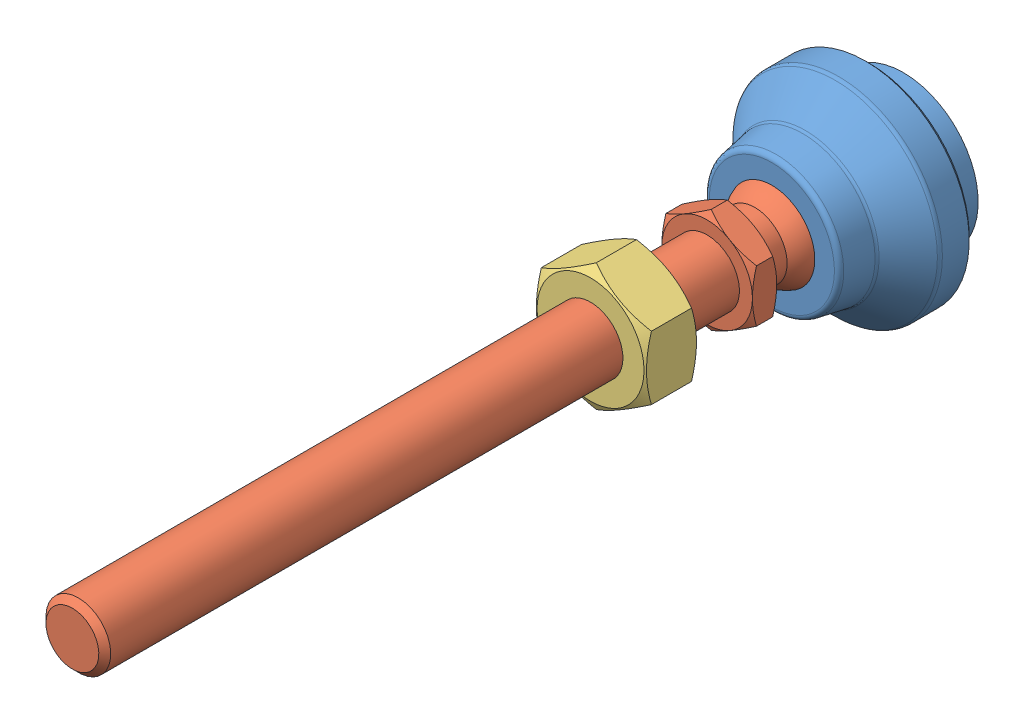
SolidWorks assembly LSVA32-M10X98.sldasm, configuration Default (file format 15000). Lengths in mm.
Overall size (32 32 128.3).
3 component instances, 3 part files, 0 mates.
Components (placement in the parent):
- LSVA32-M10X98_01-1: LSVA32-M10X98_01.SLDPRT [Default] at (0 0 5.3) x (1 0 0) z (0 -1 0) size (32 20.3 32)
- LSVA32-M10X98_02-1: LSVA32-M10X98_02.sldprt [Default] at (0 0 18.05) x (1 0 0) z (0 -1 0) size (14 117.25 16.17)
- LSVA32-M10X98_03-1: LSVA32-M10X98_03.sldprt [Default] at (0 0 40.3) size (17 19.63 8)
